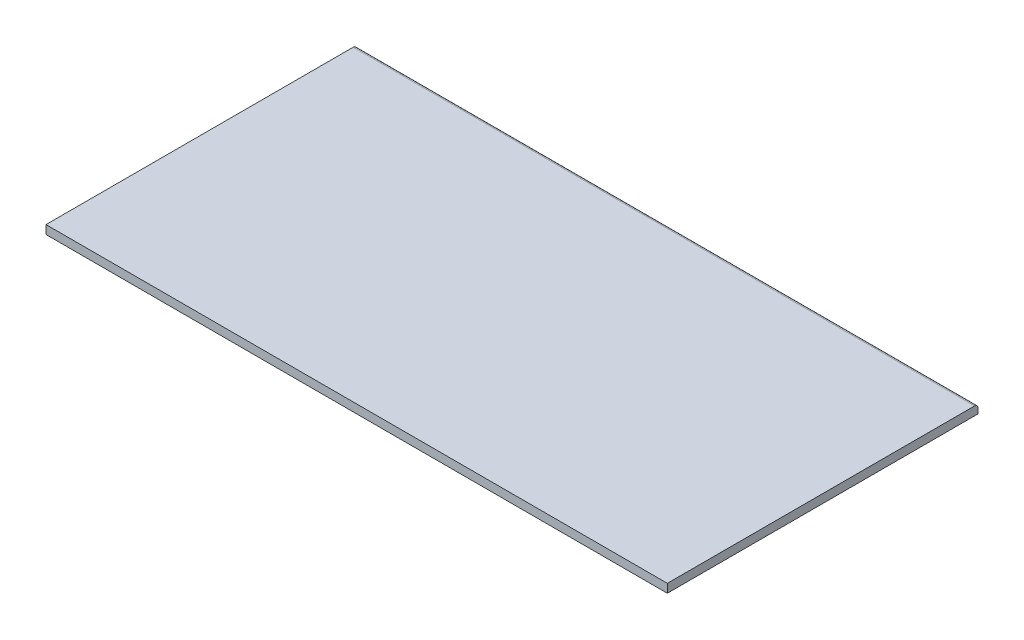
from build123d import *

# Parameters (mm, degrees)
SKETCH1_W      = 914.4
SKETCH1_H      = 457.2
EXTRUDE1_DEPTH = 12.7
FILLET1_R      = 5.08


with BuildPart() as part:
    # Sketch1 → Extrude1 (new body)
    with BuildSketch(Plane(origin=(0, 0, 0), x_dir=(1, 0, 0), z_dir=(0, 1, 0))):
        Rectangle(SKETCH1_W, SKETCH1_H)
    extrude(amount=-EXTRUDE1_DEPTH)

    # Fillet1
    fillet1_edges = [part.edges().sort_by_distance(p)[0] for p in [
        (0, 0, -228.6),
    ]]
    fillet(fillet1_edges, radius=FILLET1_R)


solid = part.part
